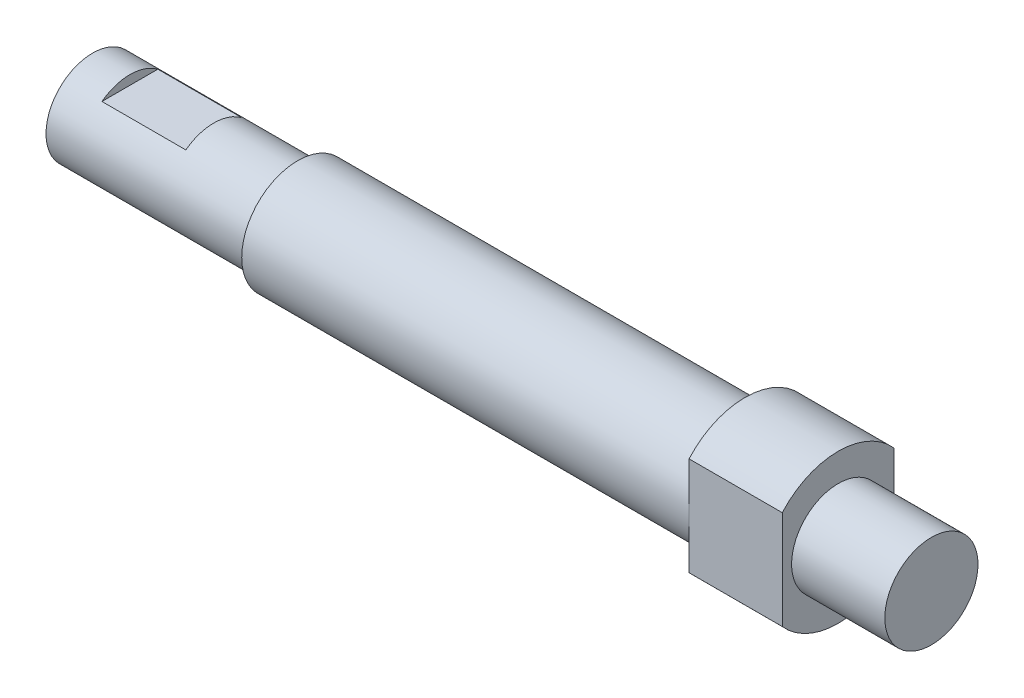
from build123d import *

# Parameters (mm, degrees)
ESQUISSE1_W                  = 45
ESQUISSE1_H                  = 4
ENL_V_START                  = -5
ESQUISSE2_R                  = 4
ESQUISSE2_R_2                = 2.5
ENL_V_MAT_EXTRU_1_DEPTH      = 5
ESQUISSE3_R                  = 4
ESQUISSE3_R_2                = 3
ENL_V_MAT_EXTRU_2_DEPTH      = 35
ESQUISSE4_R                  = 3
ESQUISSE4_R_2                = 2.5
ENL_V_MAT_EXTRU_3_DEPTH      = 11
ESQUISSE5_W                  = 5
ESQUISSE5_H                  = 8
ENL_V_MAT_EXTRU_4_DEPTH      = 1
R_P_TITION_CIRCULAIRE1_COUNT = 2
ESQUISSE7_W                  = 4.5
ESQUISSE7_H                  = 5
ENL_V_MAT_EXTRU_5_DEPTH      = 0.5


with BuildPart() as part:
    # Esquisse1 → R_volution1 (revolve)
    with BuildSketch(Plane.XY, mode=Mode.PRIVATE) as r_volution1_sk:
        with Locations((22.5, 2)):
            Rectangle(ESQUISSE1_W, ESQUISSE1_H)
    revolve(r_volution1_sk.sketch.rotate(Axis((-13.644215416, 0, 0), (1, 0, 0)), 90), axis=Axis((-13.644215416, 0, 0), (1, 0, 0)))

    # Esquisse2 → Enl_v. mat.-Extru.1 (cut)
    with BuildSketch(Plane(origin=(45, 0, 0), x_dir=(0, 0, -1), z_dir=(1, 0, 0)).offset(ENL_V_START)):
        with Locations(Location((0, 0, 0), (0, 0, 180))):
            Circle(ESQUISSE2_R)
        Circle(ESQUISSE2_R_2, mode=Mode.SUBTRACT)
    extrude(amount=ENL_V_MAT_EXTRU_1_DEPTH, mode=Mode.SUBTRACT)

    # Esquisse3 → Enl_v. mat.-Extru.2 (cut)
    with BuildSketch(Plane.ZY):
        Circle(ESQUISSE3_R)
        Circle(ESQUISSE3_R_2, mode=Mode.SUBTRACT)
    extrude(amount=-ENL_V_MAT_EXTRU_2_DEPTH, mode=Mode.SUBTRACT)

    # Esquisse4 → Enl_v. mat.-Extru.3 (cut)
    with BuildSketch(Plane.ZY):
        Circle(ESQUISSE4_R)
        with Locations(Location((0, 0, 0), (0, 0, 180))):
            Circle(ESQUISSE4_R_2, mode=Mode.SUBTRACT)
    extrude(amount=-ENL_V_MAT_EXTRU_3_DEPTH, mode=Mode.SUBTRACT)

    # Esquisse5 → Enl_v. mat.-Extru.4 (cut)
    with BuildSketch(Plane.XY.offset(-4)):
        with Locations((37.5, 0)):
            Rectangle(ESQUISSE5_W, ESQUISSE5_H)
    enl_v_mat_extru_4 = extrude(amount=ENL_V_MAT_EXTRU_4_DEPTH, mode=Mode.SUBTRACT)

    # R_p_tition circulaire1: Enl_v. mat.-Extru.4 ×2 about axis
    r_p_tition_circulaire1_axis = Axis((48.461875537, 0, 0), (-1, 0, 0))
    for i in range(1, R_P_TITION_CIRCULAIRE1_COUNT):
        add(enl_v_mat_extru_4.rotate(r_p_tition_circulaire1_axis, i * 360 / R_P_TITION_CIRCULAIRE1_COUNT), mode=Mode.SUBTRACT)

    # Esquisse7 → Enl_v. mat.-Extru.5 (cut)
    with BuildSketch(Plane(origin=(0, 2.5, 0), x_dir=(1, 0, 0), z_dir=(0, 1, 0))):
        with Locations((4.25, 0)):
            Rectangle(ESQUISSE7_W, ESQUISSE7_H)
    extrude(amount=-ENL_V_MAT_EXTRU_5_DEPTH, mode=Mode.SUBTRACT)


solid = part.part
